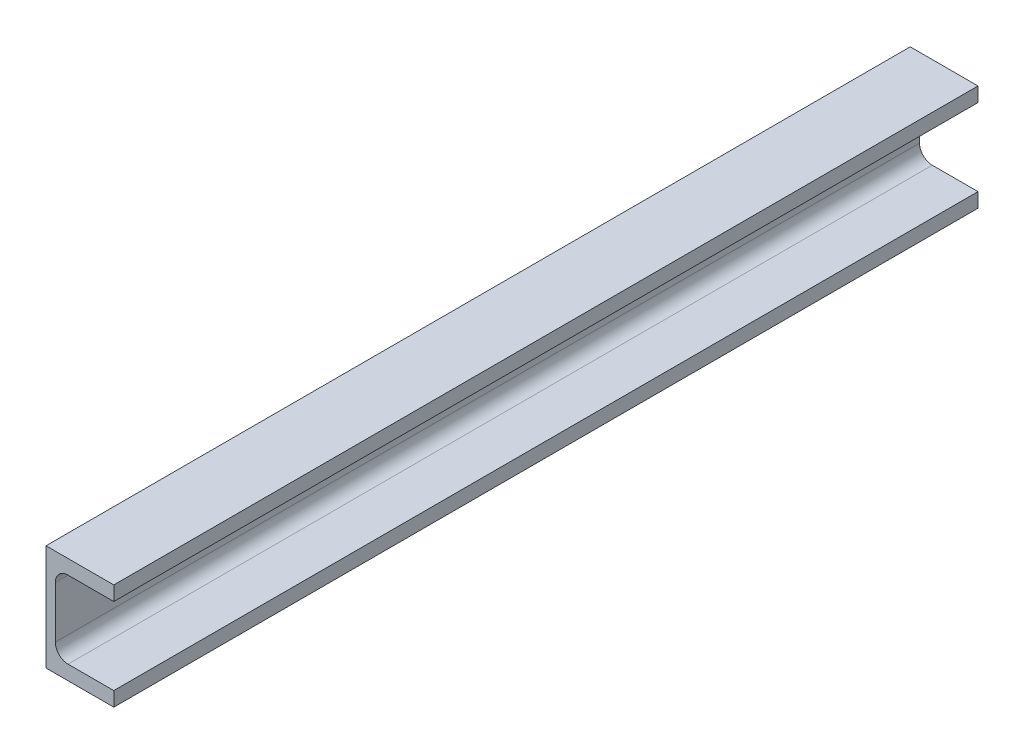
ISO-10303-21;
HEADER;
FILE_DESCRIPTION(('STEP AP214'),'2;1');
FILE_NAME('part.step','',(''),(''),'','','');
FILE_SCHEMA(('AUTOMOTIVE_DESIGN { 1 0 10303 214 1 1 1 1 }'));
ENDSEC;
DATA;
#1=APPLICATION_CONTEXT('core data for automotive mechanical design processes');
#2=APPLICATION_PROTOCOL_DEFINITION('international standard','automotive_design',2000,#1);
#3=PRODUCT_CONTEXT('',#1,'mechanical');
#4=PRODUCT('Part','Part','',(#3));
#5=PRODUCT_RELATED_PRODUCT_CATEGORY('part','',(#4));
#6=PRODUCT_DEFINITION_FORMATION('','',#4);
#7=PRODUCT_DEFINITION_CONTEXT('part definition',#1,'design');
#8=PRODUCT_DEFINITION('design','',#6,#7);
#9=PRODUCT_DEFINITION_SHAPE('','',#8);
#10=(LENGTH_UNIT() NAMED_UNIT(*) SI_UNIT(.MILLI.,.METRE.));
#11=(NAMED_UNIT(*) PLANE_ANGLE_UNIT() SI_UNIT($,.RADIAN.));
#12=(NAMED_UNIT(*) SI_UNIT($,.STERADIAN.) SOLID_ANGLE_UNIT());
#13=UNCERTAINTY_MEASURE_WITH_UNIT(LENGTH_MEASURE(1.E-05),#10,'distance_accuracy_value','');
#14=(GEOMETRIC_REPRESENTATION_CONTEXT(3) GLOBAL_UNCERTAINTY_ASSIGNED_CONTEXT((#13)) GLOBAL_UNIT_ASSIGNED_CONTEXT((#10,
#11,#12)) REPRESENTATION_CONTEXT('',''));
#15=CARTESIAN_POINT('',(0.,0.,0.));
#16=DIRECTION('',(0.,0.,1.));
#17=DIRECTION('',(1.,0.,0.));
#18=AXIS2_PLACEMENT_3D('',#15,#16,#17);
#19=CARTESIAN_POINT('',(-5.60000000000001,12.2,204.));
#20=DIRECTION('',(0.,0.,-1.));
#21=DIRECTION('',(-1.,0.,0.));
#22=AXIS2_PLACEMENT_3D('',#19,#20,#21);
#23=CYLINDRICAL_SURFACE('',#22,6.);
#24=CARTESIAN_POINT('',(-5.60000000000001,12.2,-204.));
#25=DIRECTION('',(0.,0.,-1.));
#26=DIRECTION('',(-1.,0.,0.));
#27=AXIS2_PLACEMENT_3D('',#24,#25,#26);
#28=CIRCLE('',#27,6.);
#29=CARTESIAN_POINT('',(-11.6,12.2,-204.));
#30=VERTEX_POINT('',#29);
#31=CARTESIAN_POINT('',(-5.60000000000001,18.2,-204.));
#32=VERTEX_POINT('',#31);
#33=EDGE_CURVE('E152',#30,#32,#28,.T.);
#34=ORIENTED_EDGE('',*,*,#33,.T.);
#35=DIRECTION('',(0.,0.,-1.));
#36=VECTOR('',#35,1.);
#37=CARTESIAN_POINT('',(-5.60000000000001,18.2,204.));
#38=LINE('',#37,#36);
#39=CARTESIAN_POINT('',(-5.60000000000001,18.2,204.));
#40=VERTEX_POINT('',#39);
#41=EDGE_CURVE('E11',#40,#32,#38,.T.);
#42=ORIENTED_EDGE('',*,*,#41,.F.);
#43=CARTESIAN_POINT('',(-5.60000000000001,12.2,204.));
#44=DIRECTION('',(0.,0.,-1.));
#45=DIRECTION('',(-1.,0.,0.));
#46=AXIS2_PLACEMENT_3D('',#43,#44,#45);
#47=CIRCLE('',#46,6.);
#48=CARTESIAN_POINT('',(-11.6,12.2,204.));
#49=VERTEX_POINT('',#48);
#50=EDGE_CURVE('E169',#49,#40,#47,.T.);
#51=ORIENTED_EDGE('',*,*,#50,.F.);
#52=DIRECTION('',(0.,0.,-1.));
#53=VECTOR('',#52,1.);
#54=CARTESIAN_POINT('',(-11.6,12.2,204.));
#55=LINE('',#54,#53);
#56=EDGE_CURVE('E146',#49,#30,#55,.T.);
#57=ORIENTED_EDGE('',*,*,#56,.T.);
#58=EDGE_LOOP('',(#34,#42,#51,#57));
#59=FACE_BOUND('',#58,.T.);
#60=ADVANCED_FACE('F43',(#59),#23,.F.);
#61=CARTESIAN_POINT('',(16.,18.2,204.));
#62=DIRECTION('',(0.,1.,0.));
#63=DIRECTION('',(0.,0.,1.));
#64=AXIS2_PLACEMENT_3D('',#61,#62,#63);
#65=PLANE('',#64);
#66=DIRECTION('',(1.,0.,0.));
#67=VECTOR('',#66,1.);
#68=CARTESIAN_POINT('',(16.,18.2,-204.));
#69=LINE('',#68,#67);
#70=CARTESIAN_POINT('',(16.,18.2,-204.));
#71=VERTEX_POINT('',#70);
#72=EDGE_CURVE('E151',#32,#71,#69,.T.);
#73=ORIENTED_EDGE('',*,*,#72,.T.);
#74=DIRECTION('',(0.,0.,-1.));
#75=VECTOR('',#74,1.);
#76=CARTESIAN_POINT('',(16.,18.2,204.));
#77=LINE('',#76,#75);
#78=CARTESIAN_POINT('',(16.,18.2,204.));
#79=VERTEX_POINT('',#78);
#80=EDGE_CURVE('E51',#79,#71,#77,.T.);
#81=ORIENTED_EDGE('',*,*,#80,.F.);
#82=DIRECTION('',(1.,0.,0.));
#83=VECTOR('',#82,1.);
#84=CARTESIAN_POINT('',(16.,18.2,204.));
#85=LINE('',#84,#83);
#86=EDGE_CURVE('E108',#40,#79,#85,.T.);
#87=ORIENTED_EDGE('',*,*,#86,.F.);
#88=ORIENTED_EDGE('',*,*,#41,.T.);
#89=EDGE_LOOP('',(#73,#81,#87,#88));
#90=FACE_BOUND('',#89,.T.);
#91=ADVANCED_FACE('F219',(#90),#65,.F.);
#92=CARTESIAN_POINT('',(16.,25.,204.));
#93=DIRECTION('',(-1.,0.,0.));
#94=DIRECTION('',(0.,0.,1.));
#95=AXIS2_PLACEMENT_3D('',#92,#93,#94);
#96=PLANE('',#95);
#97=DIRECTION('',(0.,1.,0.));
#98=VECTOR('',#97,1.);
#99=CARTESIAN_POINT('',(16.,25.,-204.));
#100=LINE('',#99,#98);
#101=CARTESIAN_POINT('',(16.,25.,-204.));
#102=VERTEX_POINT('',#101);
#103=EDGE_CURVE('E156',#71,#102,#100,.T.);
#104=ORIENTED_EDGE('',*,*,#103,.T.);
#105=DIRECTION('',(0.,0.,-1.));
#106=VECTOR('',#105,1.);
#107=CARTESIAN_POINT('',(16.,25.,204.));
#108=LINE('',#107,#106);
#109=CARTESIAN_POINT('',(16.,25.,204.));
#110=VERTEX_POINT('',#109);
#111=EDGE_CURVE('E185',#110,#102,#108,.T.);
#112=ORIENTED_EDGE('',*,*,#111,.F.);
#113=DIRECTION('',(0.,1.,0.));
#114=VECTOR('',#113,1.);
#115=CARTESIAN_POINT('',(16.,25.,204.));
#116=LINE('',#115,#114);
#117=EDGE_CURVE('E188',#79,#110,#116,.T.);
#118=ORIENTED_EDGE('',*,*,#117,.F.);
#119=ORIENTED_EDGE('',*,*,#80,.T.);
#120=EDGE_LOOP('',(#104,#112,#118,#119));
#121=FACE_BOUND('',#120,.T.);
#122=ADVANCED_FACE('F189',(#121),#96,.F.);
#123=CARTESIAN_POINT('',(-16.,25.,204.));
#124=DIRECTION('',(0.,-1.,0.));
#125=DIRECTION('',(0.,0.,-1.));
#126=AXIS2_PLACEMENT_3D('',#123,#124,#125);
#127=PLANE('',#126);
#128=DIRECTION('',(-1.,0.,0.));
#129=VECTOR('',#128,1.);
#130=CARTESIAN_POINT('',(-16.,25.,-204.));
#131=LINE('',#130,#129);
#132=CARTESIAN_POINT('',(-16.,25.,-204.));
#133=VERTEX_POINT('',#132);
#134=EDGE_CURVE('E157',#102,#133,#131,.T.);
#135=ORIENTED_EDGE('',*,*,#134,.T.);
#136=DIRECTION('',(0.,0.,-1.));
#137=VECTOR('',#136,1.);
#138=CARTESIAN_POINT('',(-16.,25.,204.));
#139=LINE('',#138,#137);
#140=CARTESIAN_POINT('',(-16.,25.,204.));
#141=VERTEX_POINT('',#140);
#142=EDGE_CURVE('E177',#141,#133,#139,.T.);
#143=ORIENTED_EDGE('',*,*,#142,.F.);
#144=DIRECTION('',(-1.,0.,0.));
#145=VECTOR('',#144,1.);
#146=CARTESIAN_POINT('',(-16.,25.,204.));
#147=LINE('',#146,#145);
#148=EDGE_CURVE('E206',#110,#141,#147,.T.);
#149=ORIENTED_EDGE('',*,*,#148,.F.);
#150=ORIENTED_EDGE('',*,*,#111,.T.);
#151=EDGE_LOOP('',(#135,#143,#149,#150));
#152=FACE_BOUND('',#151,.T.);
#153=ADVANCED_FACE('F198',(#152),#127,.F.);
#154=CARTESIAN_POINT('',(-16.,25.,204.));
#155=DIRECTION('',(1.,0.,0.));
#156=DIRECTION('',(0.,0.,-1.));
#157=AXIS2_PLACEMENT_3D('',#154,#155,#156);
#158=PLANE('',#157);
#159=DIRECTION('',(0.,-1.,0.));
#160=VECTOR('',#159,1.);
#161=CARTESIAN_POINT('',(-16.,25.,-204.));
#162=LINE('',#161,#160);
#163=CARTESIAN_POINT('',(-16.,-25.,-204.));
#164=VERTEX_POINT('',#163);
#165=EDGE_CURVE('E159',#133,#164,#162,.T.);
#166=ORIENTED_EDGE('',*,*,#165,.T.);
#167=DIRECTION('',(0.,0.,-1.));
#168=VECTOR('',#167,1.);
#169=CARTESIAN_POINT('',(-16.,-25.,204.));
#170=LINE('',#169,#168);
#171=CARTESIAN_POINT('',(-16.,-25.,204.));
#172=VERTEX_POINT('',#171);
#173=EDGE_CURVE('E176',#172,#164,#170,.T.);
#174=ORIENTED_EDGE('',*,*,#173,.F.);
#175=DIRECTION('',(0.,-1.,0.));
#176=VECTOR('',#175,1.);
#177=CARTESIAN_POINT('',(-16.,25.,204.));
#178=LINE('',#177,#176);
#179=EDGE_CURVE('E201',#141,#172,#178,.T.);
#180=ORIENTED_EDGE('',*,*,#179,.F.);
#181=ORIENTED_EDGE('',*,*,#142,.T.);
#182=EDGE_LOOP('',(#166,#174,#180,#181));
#183=FACE_BOUND('',#182,.T.);
#184=ADVANCED_FACE('F202',(#183),#158,.F.);
#185=CARTESIAN_POINT('',(-16.,-25.,204.));
#186=DIRECTION('',(0.,1.,0.));
#187=DIRECTION('',(0.,0.,1.));
#188=AXIS2_PLACEMENT_3D('',#185,#186,#187);
#189=PLANE('',#188);
#190=DIRECTION('',(1.,0.,0.));
#191=VECTOR('',#190,1.);
#192=CARTESIAN_POINT('',(-16.,-25.,-204.));
#193=LINE('',#192,#191);
#194=CARTESIAN_POINT('',(16.,-25.,-204.));
#195=VERTEX_POINT('',#194);
#196=EDGE_CURVE('E162',#164,#195,#193,.T.);
#197=ORIENTED_EDGE('',*,*,#196,.T.);
#198=DIRECTION('',(0.,0.,-1.));
#199=VECTOR('',#198,1.);
#200=CARTESIAN_POINT('',(16.,-25.,204.));
#201=LINE('',#200,#199);
#202=CARTESIAN_POINT('',(16.,-25.,204.));
#203=VERTEX_POINT('',#202);
#204=EDGE_CURVE('E173',#203,#195,#201,.T.);
#205=ORIENTED_EDGE('',*,*,#204,.F.);
#206=DIRECTION('',(1.,0.,0.));
#207=VECTOR('',#206,1.);
#208=CARTESIAN_POINT('',(-16.,-25.,204.));
#209=LINE('',#208,#207);
#210=EDGE_CURVE('E210',#172,#203,#209,.T.);
#211=ORIENTED_EDGE('',*,*,#210,.F.);
#212=ORIENTED_EDGE('',*,*,#173,.T.);
#213=EDGE_LOOP('',(#197,#205,#211,#212));
#214=FACE_BOUND('',#213,.T.);
#215=ADVANCED_FACE('F229',(#214),#189,.F.);
#216=CARTESIAN_POINT('',(16.,-18.2,204.));
#217=DIRECTION('',(-1.,0.,0.));
#218=DIRECTION('',(0.,0.,1.));
#219=AXIS2_PLACEMENT_3D('',#216,#217,#218);
#220=PLANE('',#219);
#221=DIRECTION('',(0.,1.,0.));
#222=VECTOR('',#221,1.);
#223=CARTESIAN_POINT('',(16.,-18.2,-204.));
#224=LINE('',#223,#222);
#225=CARTESIAN_POINT('',(16.,-18.2,-204.));
#226=VERTEX_POINT('',#225);
#227=EDGE_CURVE('E165',#195,#226,#224,.T.);
#228=ORIENTED_EDGE('',*,*,#227,.T.);
#229=DIRECTION('',(0.,0.,-1.));
#230=VECTOR('',#229,1.);
#231=CARTESIAN_POINT('',(16.,-18.2,204.));
#232=LINE('',#231,#230);
#233=CARTESIAN_POINT('',(16.,-18.2,204.));
#234=VERTEX_POINT('',#233);
#235=EDGE_CURVE('E145',#234,#226,#232,.T.);
#236=ORIENTED_EDGE('',*,*,#235,.F.);
#237=DIRECTION('',(0.,1.,0.));
#238=VECTOR('',#237,1.);
#239=CARTESIAN_POINT('',(16.,-18.2,204.));
#240=LINE('',#239,#238);
#241=EDGE_CURVE('E135',#203,#234,#240,.T.);
#242=ORIENTED_EDGE('',*,*,#241,.F.);
#243=ORIENTED_EDGE('',*,*,#204,.T.);
#244=EDGE_LOOP('',(#228,#236,#242,#243));
#245=FACE_BOUND('',#244,.T.);
#246=ADVANCED_FACE('F231',(#245),#220,.F.);
#247=CARTESIAN_POINT('',(-5.60000000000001,-18.2,204.));
#248=DIRECTION('',(0.,-1.,0.));
#249=DIRECTION('',(0.,0.,-1.));
#250=AXIS2_PLACEMENT_3D('',#247,#248,#249);
#251=PLANE('',#250);
#252=DIRECTION('',(-1.,0.,0.));
#253=VECTOR('',#252,1.);
#254=CARTESIAN_POINT('',(-5.60000000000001,-18.2,-204.));
#255=LINE('',#254,#253);
#256=CARTESIAN_POINT('',(-5.60000000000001,-18.2,-204.));
#257=VERTEX_POINT('',#256);
#258=EDGE_CURVE('E142',#226,#257,#255,.T.);
#259=ORIENTED_EDGE('',*,*,#258,.T.);
#260=DIRECTION('',(0.,0.,-1.));
#261=VECTOR('',#260,1.);
#262=CARTESIAN_POINT('',(-5.60000000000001,-18.2,204.));
#263=LINE('',#262,#261);
#264=CARTESIAN_POINT('',(-5.60000000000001,-18.2,204.));
#265=VERTEX_POINT('',#264);
#266=EDGE_CURVE('E137',#265,#257,#263,.T.);
#267=ORIENTED_EDGE('',*,*,#266,.F.);
#268=DIRECTION('',(-1.,0.,0.));
#269=VECTOR('',#268,1.);
#270=CARTESIAN_POINT('',(-5.60000000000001,-18.2,204.));
#271=LINE('',#270,#269);
#272=EDGE_CURVE('E126',#234,#265,#271,.T.);
#273=ORIENTED_EDGE('',*,*,#272,.F.);
#274=ORIENTED_EDGE('',*,*,#235,.T.);
#275=EDGE_LOOP('',(#259,#267,#273,#274));
#276=FACE_BOUND('',#275,.T.);
#277=ADVANCED_FACE('F140',(#276),#251,.F.);
#278=CARTESIAN_POINT('',(-5.60000000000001,-12.2,204.));
#279=DIRECTION('',(0.,0.,-1.));
#280=DIRECTION('',(-1.,0.,0.));
#281=AXIS2_PLACEMENT_3D('',#278,#279,#280);
#282=CYLINDRICAL_SURFACE('',#281,6.);
#283=CARTESIAN_POINT('',(-5.60000000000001,-12.2,-204.));
#284=DIRECTION('',(0.,0.,-1.));
#285=DIRECTION('',(1.,0.,0.));
#286=AXIS2_PLACEMENT_3D('',#283,#284,#285);
#287=CIRCLE('',#286,6.);
#288=CARTESIAN_POINT('',(-11.6,-12.2,-204.));
#289=VERTEX_POINT('',#288);
#290=EDGE_CURVE('E93',#257,#289,#287,.T.);
#291=ORIENTED_EDGE('',*,*,#290,.T.);
#292=DIRECTION('',(0.,0.,-1.));
#293=VECTOR('',#292,1.);
#294=CARTESIAN_POINT('',(-11.6,-12.2,204.));
#295=LINE('',#294,#293);
#296=CARTESIAN_POINT('',(-11.6,-12.2,204.));
#297=VERTEX_POINT('',#296);
#298=EDGE_CURVE('E141',#297,#289,#295,.T.);
#299=ORIENTED_EDGE('',*,*,#298,.F.);
#300=CARTESIAN_POINT('',(-5.60000000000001,-12.2,204.));
#301=DIRECTION('',(0.,0.,-1.));
#302=DIRECTION('',(1.,0.,0.));
#303=AXIS2_PLACEMENT_3D('',#300,#301,#302);
#304=CIRCLE('',#303,6.);
#305=EDGE_CURVE('E134',#265,#297,#304,.T.);
#306=ORIENTED_EDGE('',*,*,#305,.F.);
#307=ORIENTED_EDGE('',*,*,#266,.T.);
#308=EDGE_LOOP('',(#291,#299,#306,#307));
#309=FACE_BOUND('',#308,.T.);
#310=ADVANCED_FACE('F143',(#309),#282,.F.);
#311=CARTESIAN_POINT('',(-11.6,12.2,204.));
#312=DIRECTION('',(-1.,0.,0.));
#313=DIRECTION('',(0.,0.,1.));
#314=AXIS2_PLACEMENT_3D('',#311,#312,#313);
#315=PLANE('',#314);
#316=DIRECTION('',(0.,1.,0.));
#317=VECTOR('',#316,1.);
#318=CARTESIAN_POINT('',(-11.6,12.2,-204.));
#319=LINE('',#318,#317);
#320=EDGE_CURVE('E99',#289,#30,#319,.T.);
#321=ORIENTED_EDGE('',*,*,#320,.T.);
#322=ORIENTED_EDGE('',*,*,#56,.F.);
#323=DIRECTION('',(0.,1.,0.));
#324=VECTOR('',#323,1.);
#325=CARTESIAN_POINT('',(-11.6,12.2,204.));
#326=LINE('',#325,#324);
#327=EDGE_CURVE('E56',#297,#49,#326,.T.);
#328=ORIENTED_EDGE('',*,*,#327,.F.);
#329=ORIENTED_EDGE('',*,*,#298,.T.);
#330=EDGE_LOOP('',(#321,#322,#328,#329));
#331=FACE_BOUND('',#330,.T.);
#332=ADVANCED_FACE('F245',(#331),#315,.F.);
#333=CARTESIAN_POINT('',(-5.60000000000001,12.2,204.));
#334=DIRECTION('',(0.,0.,-1.));
#335=DIRECTION('',(-1.,0.,0.));
#336=AXIS2_PLACEMENT_3D('',#333,#334,#335);
#337=PLANE('',#336);
#338=ORIENTED_EDGE('',*,*,#50,.T.);
#339=ORIENTED_EDGE('',*,*,#86,.T.);
#340=ORIENTED_EDGE('',*,*,#117,.T.);
#341=ORIENTED_EDGE('',*,*,#148,.T.);
#342=ORIENTED_EDGE('',*,*,#179,.T.);
#343=ORIENTED_EDGE('',*,*,#210,.T.);
#344=ORIENTED_EDGE('',*,*,#241,.T.);
#345=ORIENTED_EDGE('',*,*,#272,.T.);
#346=ORIENTED_EDGE('',*,*,#305,.T.);
#347=ORIENTED_EDGE('',*,*,#327,.T.);
#348=EDGE_LOOP('',(#338,#339,#340,#341,#342,#343,#344,#345,#346,#347));
#349=FACE_BOUND('',#348,.T.);
#350=ADVANCED_FACE('F128',(#349),#337,.F.);
#351=CARTESIAN_POINT('',(-5.60000000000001,12.2,-204.));
#352=DIRECTION('',(0.,0.,-1.));
#353=DIRECTION('',(-1.,0.,0.));
#354=AXIS2_PLACEMENT_3D('',#351,#352,#353);
#355=PLANE('',#354);
#356=ORIENTED_EDGE('',*,*,#33,.F.);
#357=ORIENTED_EDGE('',*,*,#320,.F.);
#358=ORIENTED_EDGE('',*,*,#290,.F.);
#359=ORIENTED_EDGE('',*,*,#258,.F.);
#360=ORIENTED_EDGE('',*,*,#227,.F.);
#361=ORIENTED_EDGE('',*,*,#196,.F.);
#362=ORIENTED_EDGE('',*,*,#165,.F.);
#363=ORIENTED_EDGE('',*,*,#134,.F.);
#364=ORIENTED_EDGE('',*,*,#103,.F.);
#365=ORIENTED_EDGE('',*,*,#72,.F.);
#366=EDGE_LOOP('',(#356,#357,#358,#359,#360,#361,#362,#363,#364,#365));
#367=FACE_BOUND('',#366,.T.);
#368=ADVANCED_FACE('F193',(#367),#355,.T.);
#369=CLOSED_SHELL('',(#60,#91,#122,#153,#184,#215,#246,#277,#310,#332,#350,#368));
#370=MANIFOLD_SOLID_BREP('B2',#369);
#371=ADVANCED_BREP_SHAPE_REPRESENTATION('',(#18,#370),#14);
#372=SHAPE_DEFINITION_REPRESENTATION(#9,#371);
ENDSEC;
END-ISO-10303-21;
